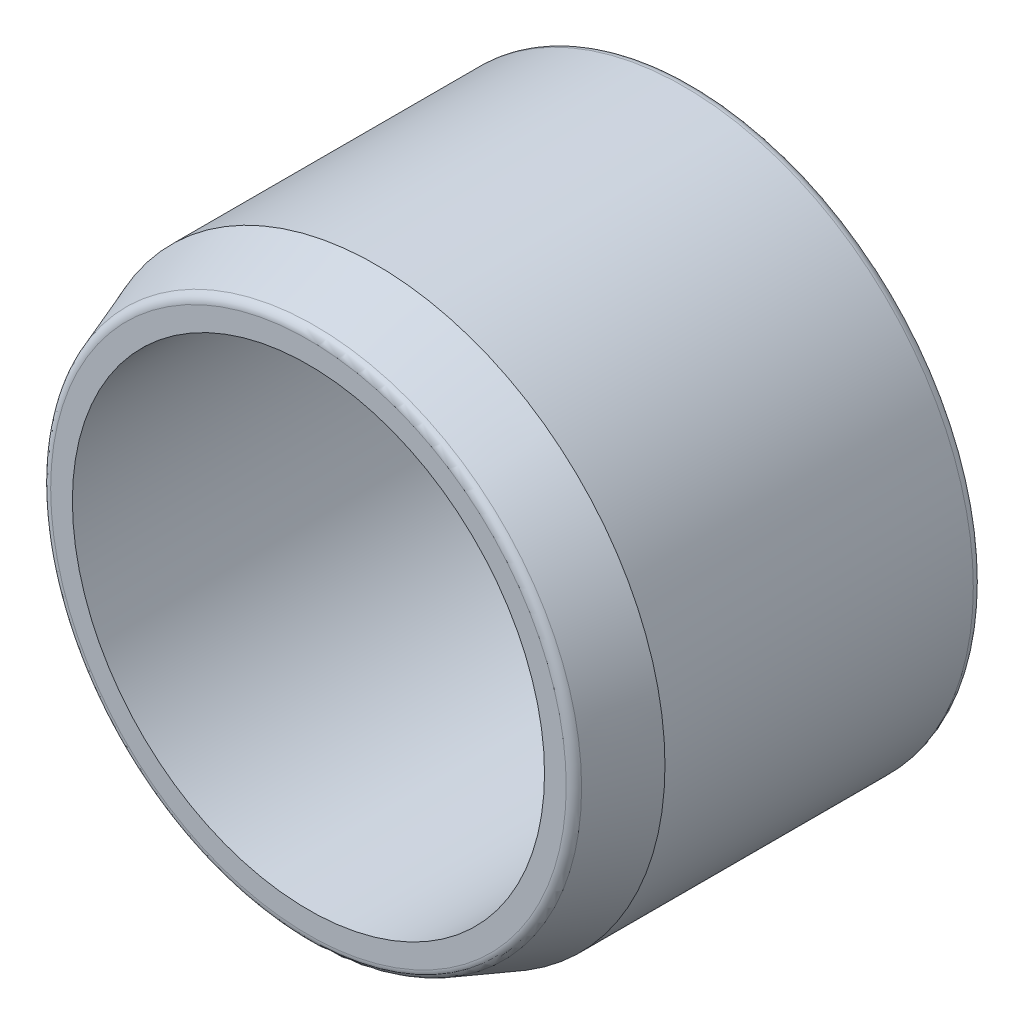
from build123d import *

# Parameters (mm, degrees)
SKETCH1_R           = 30
SKETCH1_R_2         = 24.5
BOSS_EXTRUDE1_DEPTH = 40
CHAMFER1_SIZE       = 7
CHAMFER1_SIZE2      = 2.54779164
FILLET1_R           = 1


with BuildPart() as part:
    # Sketch1 → Boss-Extrude1 (new body)
    with BuildSketch(Plane.XY):
        Circle(SKETCH1_R)
        Circle(SKETCH1_R_2, mode=Mode.SUBTRACT)
    extrude(amount=BOSS_EXTRUDE1_DEPTH)

    # Chamfer1
    chamfer1_edges = [part.edges().sort_by_distance(p)[0] for p in [
        (-30, 0, 40),
    ]]
    chamfer1_side = [part.faces().sort_by_distance(p)[0] for p in [
        (-30, 0, 20),
    ]]
    chamfer(chamfer1_edges, length=CHAMFER1_SIZE, length2=CHAMFER1_SIZE2, reference=chamfer1_side[0])

    # Fillet1
    fillet1_edges = [part.edges().sort_by_distance(p)[0] for p in [
        (-27.45220836, 0, 40),
        (-30, 0, 0),
    ]]
    fillet(fillet1_edges, radius=FILLET1_R)


solid = part.part
